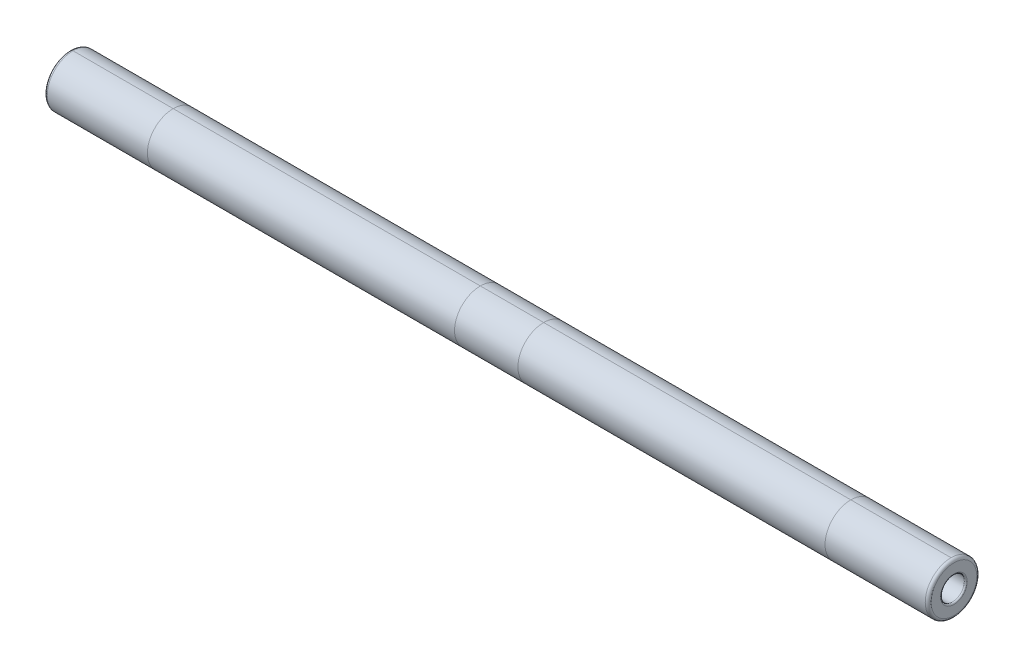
from build123d import *

# Parameters (mm, degrees)
SCHIZZO1_W               = 600
SCHIZZO1_H               = 17.5
RACCORDO1_R              = 2
SCHIZZO3_R               = 8
TAGLIO_ESTRUSIONE1_DEPTH = 75
TAGLIO_ESTRUSIONE2_START = -75
SCHIZZO4_R               = 8
TAGLIO_ESTRUSIONE2_DEPTH = 75
RACCORDO3_R              = 1


with BuildPart() as part:
    # Schizzo1 → Rivoluzione1 (revolve)
    with BuildSketch(Plane.XY, mode=Mode.PRIVATE) as rivoluzione1_sk:
        with Locations((0, 8.75)):
            Rectangle(SCHIZZO1_W, SCHIZZO1_H)
    revolve(rivoluzione1_sk.sketch.rotate(Axis((-300, 0, 0), (1, 0, 0)), 180), axis=Axis((-300, 0, 0), (1, 0, 0)))

    # Raccordo1
    raccordo1_edges = [part.edges().sort_by_distance(p)[0] for p in [
        (300, 17.5, 0),
        (-300, 17.5, 0),
    ]]
    fillet(raccordo1_edges, radius=RACCORDO1_R)

    # Schizzo3 → Taglio-Estrusione1 (cut)
    with BuildSketch(Plane.ZY.offset(300)):
        with Locations(Location((0, 0, 0), (0, 0, 270))):
            Circle(SCHIZZO3_R)
    extrude(amount=-TAGLIO_ESTRUSIONE1_DEPTH, mode=Mode.SUBTRACT)

    # Schizzo4 → Taglio-Estrusione2 (cut)
    with BuildSketch(Plane(origin=(300, 0, 0), x_dir=(0, 0, -1), z_dir=(1, 0, 0)).offset(TAGLIO_ESTRUSIONE2_START)):
        with Locations(Location((0, 0, 0), (0, 0, 270))):
            Circle(SCHIZZO4_R)
    extrude(amount=TAGLIO_ESTRUSIONE2_DEPTH, mode=Mode.SUBTRACT)

    # Raccordo3
    raccordo3_edges = [part.edges().sort_by_distance(p)[0] for p in [
        (-300, 8, 0),
        (300, 8, 0),
    ]]
    fillet(raccordo3_edges, radius=RACCORDO3_R)


solid = part.part
